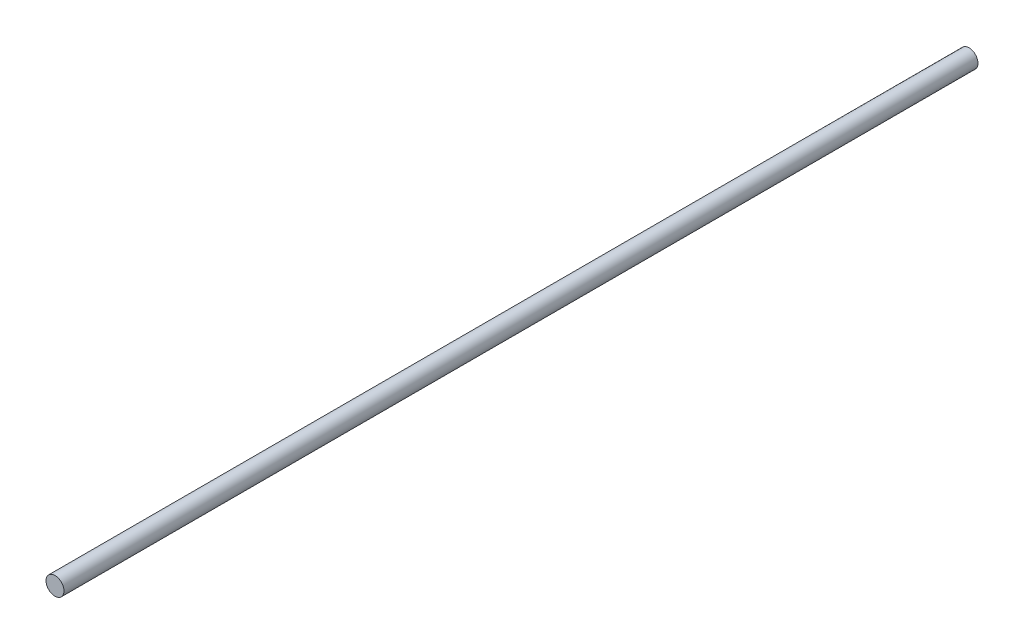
ISO-10303-21;
HEADER;
FILE_DESCRIPTION(('STEP AP214'),'2;1');
FILE_NAME('part.step','',(''),(''),'','','');
FILE_SCHEMA(('AUTOMOTIVE_DESIGN { 1 0 10303 214 1 1 1 1 }'));
ENDSEC;
DATA;
#1=APPLICATION_CONTEXT('core data for automotive mechanical design processes');
#2=APPLICATION_PROTOCOL_DEFINITION('international standard','automotive_design',2000,#1);
#3=PRODUCT_CONTEXT('',#1,'mechanical');
#4=PRODUCT('Part','Part','',(#3));
#5=PRODUCT_RELATED_PRODUCT_CATEGORY('part','',(#4));
#6=PRODUCT_DEFINITION_FORMATION('','',#4);
#7=PRODUCT_DEFINITION_CONTEXT('part definition',#1,'design');
#8=PRODUCT_DEFINITION('design','',#6,#7);
#9=PRODUCT_DEFINITION_SHAPE('','',#8);
#10=(LENGTH_UNIT() NAMED_UNIT(*) SI_UNIT(.MILLI.,.METRE.));
#11=(NAMED_UNIT(*) PLANE_ANGLE_UNIT() SI_UNIT($,.RADIAN.));
#12=(NAMED_UNIT(*) SI_UNIT($,.STERADIAN.) SOLID_ANGLE_UNIT());
#13=UNCERTAINTY_MEASURE_WITH_UNIT(LENGTH_MEASURE(1.E-05),#10,'distance_accuracy_value','');
#14=(GEOMETRIC_REPRESENTATION_CONTEXT(3) GLOBAL_UNCERTAINTY_ASSIGNED_CONTEXT((#13)) GLOBAL_UNIT_ASSIGNED_CONTEXT((#10,
#11,#12)) REPRESENTATION_CONTEXT('',''));
#15=CARTESIAN_POINT('',(0.,0.,0.));
#16=DIRECTION('',(0.,0.,1.));
#17=DIRECTION('',(1.,0.,0.));
#18=AXIS2_PLACEMENT_3D('',#15,#16,#17);
#19=CARTESIAN_POINT('',(0.,0.,-3050.));
#20=DIRECTION('',(0.,0.,1.));
#21=DIRECTION('',(1.,0.,0.));
#22=AXIS2_PLACEMENT_3D('',#19,#20,#21);
#23=CYLINDRICAL_SURFACE('',#22,30.);
#24=CARTESIAN_POINT('',(0.,0.,-3050.));
#25=DIRECTION('',(0.,0.,1.));
#26=DIRECTION('',(1.,0.,0.));
#27=AXIS2_PLACEMENT_3D('',#24,#25,#26);
#28=CIRCLE('',#27,30.);
#29=CARTESIAN_POINT('',(30.,0.,-3050.));
#30=VERTEX_POINT('',#29);
#31=EDGE_CURVE('E10',#30,#30,#28,.T.);
#32=ORIENTED_EDGE('',*,*,#31,.T.);
#33=EDGE_LOOP('',(#32));
#34=FACE_BOUND('',#33,.T.);
#35=CARTESIAN_POINT('',(0.,0.,0.));
#36=DIRECTION('',(0.,0.,1.));
#37=DIRECTION('',(1.,0.,0.));
#38=AXIS2_PLACEMENT_3D('',#35,#36,#37);
#39=CIRCLE('',#38,30.);
#40=CARTESIAN_POINT('',(30.,0.,0.));
#41=VERTEX_POINT('',#40);
#42=EDGE_CURVE('E40',#41,#41,#39,.T.);
#43=ORIENTED_EDGE('',*,*,#42,.F.);
#44=EDGE_LOOP('',(#43));
#45=FACE_BOUND('',#44,.T.);
#46=ADVANCED_FACE('F37',(#34,#45),#23,.T.);
#47=CARTESIAN_POINT('',(0.,0.,-3050.));
#48=DIRECTION('',(0.,0.,1.));
#49=DIRECTION('',(1.,0.,0.));
#50=AXIS2_PLACEMENT_3D('',#47,#48,#49);
#51=PLANE('',#50);
#52=ORIENTED_EDGE('',*,*,#31,.F.);
#53=EDGE_LOOP('',(#52));
#54=FACE_BOUND('',#53,.T.);
#55=ADVANCED_FACE('F54',(#54),#51,.F.);
#56=CARTESIAN_POINT('',(0.,0.,0.));
#57=DIRECTION('',(0.,0.,1.));
#58=DIRECTION('',(1.,0.,0.));
#59=AXIS2_PLACEMENT_3D('',#56,#57,#58);
#60=PLANE('',#59);
#61=ORIENTED_EDGE('',*,*,#42,.T.);
#62=EDGE_LOOP('',(#61));
#63=FACE_BOUND('',#62,.T.);
#64=ADVANCED_FACE('F51',(#63),#60,.T.);
#65=CLOSED_SHELL('',(#46,#55,#64));
#66=MANIFOLD_SOLID_BREP('B2',#65);
#67=ADVANCED_BREP_SHAPE_REPRESENTATION('',(#18,#66),#14);
#68=SHAPE_DEFINITION_REPRESENTATION(#9,#67);
ENDSEC;
END-ISO-10303-21;
